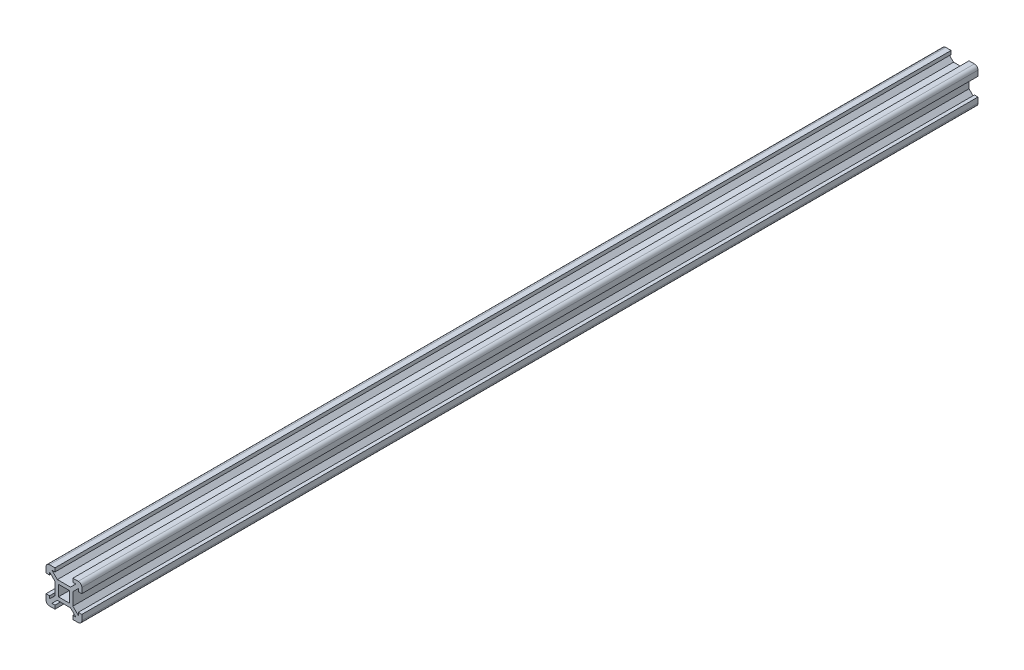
ISO-10303-21;
HEADER;
FILE_DESCRIPTION(('STEP AP214'),'2;1');
FILE_NAME('part.step','',(''),(''),'','','');
FILE_SCHEMA(('AUTOMOTIVE_DESIGN { 1 0 10303 214 1 1 1 1 }'));
ENDSEC;
DATA;
#1=APPLICATION_CONTEXT('core data for automotive mechanical design processes');
#2=APPLICATION_PROTOCOL_DEFINITION('international standard','automotive_design',2000,#1);
#3=PRODUCT_CONTEXT('',#1,'mechanical');
#4=PRODUCT('Part','Part','',(#3));
#5=PRODUCT_RELATED_PRODUCT_CATEGORY('part','',(#4));
#6=PRODUCT_DEFINITION_FORMATION('','',#4);
#7=PRODUCT_DEFINITION_CONTEXT('part definition',#1,'design');
#8=PRODUCT_DEFINITION('design','',#6,#7);
#9=PRODUCT_DEFINITION_SHAPE('','',#8);
#10=(LENGTH_UNIT() NAMED_UNIT(*) SI_UNIT(.MILLI.,.METRE.));
#11=(NAMED_UNIT(*) PLANE_ANGLE_UNIT() SI_UNIT($,.RADIAN.));
#12=(NAMED_UNIT(*) SI_UNIT($,.STERADIAN.) SOLID_ANGLE_UNIT());
#13=UNCERTAINTY_MEASURE_WITH_UNIT(LENGTH_MEASURE(1.E-05),#10,'distance_accuracy_value','');
#14=(GEOMETRIC_REPRESENTATION_CONTEXT(3) GLOBAL_UNCERTAINTY_ASSIGNED_CONTEXT((#13)) GLOBAL_UNIT_ASSIGNED_CONTEXT((#10,
#11,#12)) REPRESENTATION_CONTEXT('',''));
#15=CARTESIAN_POINT('',(0.,0.,0.));
#16=DIRECTION('',(0.,0.,1.));
#17=DIRECTION('',(1.,0.,0.));
#18=AXIS2_PLACEMENT_3D('',#15,#16,#17);
#19=CARTESIAN_POINT('',(2.00000000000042,18.0000000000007,500.));
#20=DIRECTION('',(0.,0.,-1.));
#21=DIRECTION('',(-1.,0.,0.));
#22=AXIS2_PLACEMENT_3D('',#19,#20,#21);
#23=PLANE('',#22);
#24=DIRECTION('',(0.712320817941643,-0.701854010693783,0.));
#25=VECTOR('',#24,1.);
#26=CARTESIAN_POINT('',(5.00000000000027,13.5226684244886,500.));
#27=LINE('',#26,#25);
#28=CARTESIAN_POINT('',(2.00000000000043,16.4785865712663,500.));
#29=VERTEX_POINT('',#28);
#30=CARTESIAN_POINT('',(5.00000000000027,13.5226684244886,500.));
#31=VERTEX_POINT('',#30);
#32=EDGE_CURVE('E348',#29,#31,#27,.T.);
#33=ORIENTED_EDGE('',*,*,#32,.T.);
#34=DIRECTION('',(0.,-1.,0.));
#35=VECTOR('',#34,1.);
#36=CARTESIAN_POINT('',(5.00000000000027,13.5226684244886,500.));
#37=LINE('',#36,#35);
#38=CARTESIAN_POINT('',(5.00000000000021,6.47733157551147,500.));
#39=VERTEX_POINT('',#38);
#40=EDGE_CURVE('E351',#31,#39,#37,.T.);
#41=ORIENTED_EDGE('',*,*,#40,.T.);
#42=DIRECTION('',(-0.712320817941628,-0.701854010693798,0.));
#43=VECTOR('',#42,1.);
#44=CARTESIAN_POINT('',(5.00000000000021,6.47733157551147,500.));
#45=LINE('',#44,#43);
#46=CARTESIAN_POINT('',(2.00000000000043,3.52141342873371,500.));
#47=VERTEX_POINT('',#46);
#48=EDGE_CURVE('E354',#39,#47,#45,.T.);
#49=ORIENTED_EDGE('',*,*,#48,.T.);
#50=DIRECTION('',(0.,1.,0.));
#51=VECTOR('',#50,1.);
#52=CARTESIAN_POINT('',(2.00000000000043,3.52141342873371,500.));
#53=LINE('',#52,#51);
#54=CARTESIAN_POINT('',(2.00000000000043,4.99999999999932,500.));
#55=VERTEX_POINT('',#54);
#56=EDGE_CURVE('E356',#47,#55,#53,.T.);
#57=ORIENTED_EDGE('',*,*,#56,.T.);
#58=DIRECTION('',(-1.,0.,0.));
#59=VECTOR('',#58,1.);
#60=CARTESIAN_POINT('',(4.24509251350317E-13,4.99999999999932,500.));
#61=LINE('',#60,#59);
#62=CARTESIAN_POINT('',(4.24509251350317E-13,4.99999999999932,500.));
#63=VERTEX_POINT('',#62);
#64=EDGE_CURVE('E358',#55,#63,#61,.T.);
#65=ORIENTED_EDGE('',*,*,#64,.T.);
#66=DIRECTION('',(0.,-1.,0.));
#67=VECTOR('',#66,1.);
#68=CARTESIAN_POINT('',(4.24509251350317E-13,4.99999999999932,500.));
#69=LINE('',#68,#67);
#70=CARTESIAN_POINT('',(4.24509251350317E-13,1.99999999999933,500.));
#71=VERTEX_POINT('',#70);
#72=EDGE_CURVE('E360',#63,#71,#69,.T.);
#73=ORIENTED_EDGE('',*,*,#72,.T.);
#74=CARTESIAN_POINT('',(2.00000000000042,1.99999999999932,500.));
#75=DIRECTION('',(0.,0.,1.));
#76=DIRECTION('',(1.,0.,0.));
#77=AXIS2_PLACEMENT_3D('',#74,#75,#76);
#78=CIRCLE('',#77,2.);
#79=CARTESIAN_POINT('',(2.00000000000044,-6.83481049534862E-13,500.));
#80=VERTEX_POINT('',#79);
#81=EDGE_CURVE('E362',#71,#80,#78,.T.);
#82=ORIENTED_EDGE('',*,*,#81,.T.);
#83=DIRECTION('',(1.,0.,0.));
#84=VECTOR('',#83,1.);
#85=CARTESIAN_POINT('',(2.00000000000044,-6.83481049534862E-13,500.));
#86=LINE('',#85,#84);
#87=CARTESIAN_POINT('',(5.,-6.83481049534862E-13,500.));
#88=VERTEX_POINT('',#87);
#89=EDGE_CURVE('E364',#80,#88,#86,.T.);
#90=ORIENTED_EDGE('',*,*,#89,.T.);
#91=DIRECTION('',(0.,1.,0.));
#92=VECTOR('',#91,1.);
#93=CARTESIAN_POINT('',(5.,-6.83481049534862E-13,500.));
#94=LINE('',#93,#92);
#95=CARTESIAN_POINT('',(5.,2.,500.));
#96=VERTEX_POINT('',#95);
#97=EDGE_CURVE('E366',#88,#96,#94,.T.);
#98=ORIENTED_EDGE('',*,*,#97,.T.);
#99=DIRECTION('',(-1.,0.,0.));
#100=VECTOR('',#99,1.);
#101=CARTESIAN_POINT('',(3.30549306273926,1.99999999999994,500.));
#102=LINE('',#101,#100);
#103=CARTESIAN_POINT('',(3.30549306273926,1.99999999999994,500.));
#104=VERTEX_POINT('',#103);
#105=EDGE_CURVE('E368',#96,#104,#102,.T.);
#106=ORIENTED_EDGE('',*,*,#105,.T.);
#107=DIRECTION('',(0.712320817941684,0.701854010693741,0.));
#108=VECTOR('',#107,1.);
#109=CARTESIAN_POINT('',(6.35023231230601,4.99999999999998,500.));
#110=LINE('',#109,#108);
#111=CARTESIAN_POINT('',(6.35023231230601,4.99999999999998,500.));
#112=VERTEX_POINT('',#111);
#113=EDGE_CURVE('E370',#104,#112,#110,.T.);
#114=ORIENTED_EDGE('',*,*,#113,.T.);
#115=DIRECTION('',(1.,0.,0.));
#116=VECTOR('',#115,1.);
#117=CARTESIAN_POINT('',(6.35023231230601,4.99999999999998,500.));
#118=LINE('',#117,#116);
#119=CARTESIAN_POINT('',(13.649767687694,4.99999999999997,500.));
#120=VERTEX_POINT('',#119);
#121=EDGE_CURVE('E372',#112,#120,#118,.T.);
#122=ORIENTED_EDGE('',*,*,#121,.T.);
#123=DIRECTION('',(0.712320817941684,-0.701854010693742,0.));
#124=VECTOR('',#123,1.);
#125=CARTESIAN_POINT('',(13.649767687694,4.99999999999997,500.));
#126=LINE('',#125,#124);
#127=CARTESIAN_POINT('',(16.6945069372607,1.99999999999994,500.));
#128=VERTEX_POINT('',#127);
#129=EDGE_CURVE('E374',#120,#128,#126,.T.);
#130=ORIENTED_EDGE('',*,*,#129,.T.);
#131=DIRECTION('',(-1.,0.,0.));
#132=VECTOR('',#131,1.);
#133=CARTESIAN_POINT('',(16.6945069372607,1.99999999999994,500.));
#134=LINE('',#133,#132);
#135=CARTESIAN_POINT('',(15.,2.,500.));
#136=VERTEX_POINT('',#135);
#137=EDGE_CURVE('E376',#128,#136,#134,.T.);
#138=ORIENTED_EDGE('',*,*,#137,.T.);
#139=DIRECTION('',(0.,-1.,0.));
#140=VECTOR('',#139,1.);
#141=CARTESIAN_POINT('',(15.,-6.83481049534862E-13,500.));
#142=LINE('',#141,#140);
#143=CARTESIAN_POINT('',(15.,-6.83481049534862E-13,500.));
#144=VERTEX_POINT('',#143);
#145=EDGE_CURVE('E378',#136,#144,#142,.T.);
#146=ORIENTED_EDGE('',*,*,#145,.T.);
#147=DIRECTION('',(1.,0.,0.));
#148=VECTOR('',#147,1.);
#149=CARTESIAN_POINT('',(17.9999999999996,-6.85562717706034E-13,500.));
#150=LINE('',#149,#148);
#151=CARTESIAN_POINT('',(17.9999999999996,-6.85562717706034E-13,500.));
#152=VERTEX_POINT('',#151);
#153=EDGE_CURVE('E380',#144,#152,#150,.T.);
#154=ORIENTED_EDGE('',*,*,#153,.T.);
#155=CARTESIAN_POINT('',(17.9999999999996,1.99999999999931,500.));
#156=DIRECTION('',(0.,0.,1.));
#157=DIRECTION('',(1.,0.,0.));
#158=AXIS2_PLACEMENT_3D('',#155,#156,#157);
#159=CIRCLE('',#158,2.);
#160=CARTESIAN_POINT('',(19.9999999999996,1.99999999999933,500.));
#161=VERTEX_POINT('',#160);
#162=EDGE_CURVE('E382',#152,#161,#159,.T.);
#163=ORIENTED_EDGE('',*,*,#162,.T.);
#164=DIRECTION('',(0.,1.,0.));
#165=VECTOR('',#164,1.);
#166=CARTESIAN_POINT('',(19.9999999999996,4.99999999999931,500.));
#167=LINE('',#166,#165);
#168=CARTESIAN_POINT('',(19.9999999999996,4.99999999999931,500.));
#169=VERTEX_POINT('',#168);
#170=EDGE_CURVE('E384',#161,#169,#167,.T.);
#171=ORIENTED_EDGE('',*,*,#170,.T.);
#172=DIRECTION('',(-1.,0.,0.));
#173=VECTOR('',#172,1.);
#174=CARTESIAN_POINT('',(19.9999999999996,4.99999999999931,500.));
#175=LINE('',#174,#173);
#176=CARTESIAN_POINT('',(17.9999999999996,4.99999999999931,500.));
#177=VERTEX_POINT('',#176);
#178=EDGE_CURVE('E386',#169,#177,#175,.T.);
#179=ORIENTED_EDGE('',*,*,#178,.T.);
#180=DIRECTION('',(0.,-1.,0.));
#181=VECTOR('',#180,1.);
#182=CARTESIAN_POINT('',(17.9999999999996,3.52141342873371,500.));
#183=LINE('',#182,#181);
#184=CARTESIAN_POINT('',(17.9999999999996,3.52141342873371,500.));
#185=VERTEX_POINT('',#184);
#186=EDGE_CURVE('E388',#177,#185,#183,.T.);
#187=ORIENTED_EDGE('',*,*,#186,.T.);
#188=DIRECTION('',(-0.712320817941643,0.701854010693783,0.));
#189=VECTOR('',#188,1.);
#190=CARTESIAN_POINT('',(14.9999999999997,6.47733157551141,500.));
#191=LINE('',#190,#189);
#192=CARTESIAN_POINT('',(14.9999999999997,6.47733157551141,500.));
#193=VERTEX_POINT('',#192);
#194=EDGE_CURVE('E390',#185,#193,#191,.T.);
#195=ORIENTED_EDGE('',*,*,#194,.T.);
#196=DIRECTION('',(0.,1.,0.));
#197=VECTOR('',#196,1.);
#198=CARTESIAN_POINT('',(14.9999999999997,13.5226684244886,500.));
#199=LINE('',#198,#197);
#200=CARTESIAN_POINT('',(14.9999999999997,13.5226684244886,500.));
#201=VERTEX_POINT('',#200);
#202=EDGE_CURVE('E392',#193,#201,#199,.T.);
#203=ORIENTED_EDGE('',*,*,#202,.T.);
#204=DIRECTION('',(0.712320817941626,0.7018540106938,0.));
#205=VECTOR('',#204,1.);
#206=CARTESIAN_POINT('',(14.9999999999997,13.5226684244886,500.));
#207=LINE('',#206,#205);
#208=CARTESIAN_POINT('',(17.9999999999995,16.4785865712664,500.));
#209=VERTEX_POINT('',#208);
#210=EDGE_CURVE('E394',#201,#209,#207,.T.);
#211=ORIENTED_EDGE('',*,*,#210,.T.);
#212=DIRECTION('',(0.,-1.,0.));
#213=VECTOR('',#212,1.);
#214=CARTESIAN_POINT('',(17.9999999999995,16.4785865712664,500.));
#215=LINE('',#214,#213);
#216=CARTESIAN_POINT('',(17.9999999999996,15.0000000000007,500.));
#217=VERTEX_POINT('',#216);
#218=EDGE_CURVE('E396',#209,#217,#215,.T.);
#219=ORIENTED_EDGE('',*,*,#218,.T.);
#220=DIRECTION('',(1.,0.,0.));
#221=VECTOR('',#220,1.);
#222=CARTESIAN_POINT('',(19.9999999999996,15.0000000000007,500.));
#223=LINE('',#222,#221);
#224=CARTESIAN_POINT('',(19.9999999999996,15.0000000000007,500.));
#225=VERTEX_POINT('',#224);
#226=EDGE_CURVE('E398',#217,#225,#223,.T.);
#227=ORIENTED_EDGE('',*,*,#226,.T.);
#228=DIRECTION('',(0.,1.,0.));
#229=VECTOR('',#228,1.);
#230=CARTESIAN_POINT('',(19.9999999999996,15.0000000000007,500.));
#231=LINE('',#230,#229);
#232=CARTESIAN_POINT('',(19.9999999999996,18.0000000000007,500.));
#233=VERTEX_POINT('',#232);
#234=EDGE_CURVE('E400',#225,#233,#231,.T.);
#235=ORIENTED_EDGE('',*,*,#234,.T.);
#236=CARTESIAN_POINT('',(17.9999999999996,18.0000000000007,500.));
#237=DIRECTION('',(0.,0.,1.));
#238=DIRECTION('',(1.,0.,0.));
#239=AXIS2_PLACEMENT_3D('',#236,#237,#238);
#240=CIRCLE('',#239,2.);
#241=CARTESIAN_POINT('',(17.9999999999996,20.0000000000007,500.));
#242=VERTEX_POINT('',#241);
#243=EDGE_CURVE('E402',#233,#242,#240,.T.);
#244=ORIENTED_EDGE('',*,*,#243,.T.);
#245=DIRECTION('',(-1.,0.,0.));
#246=VECTOR('',#245,1.);
#247=CARTESIAN_POINT('',(17.9999999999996,20.0000000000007,500.));
#248=LINE('',#247,#246);
#249=CARTESIAN_POINT('',(15.,20.0000000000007,500.));
#250=VERTEX_POINT('',#249);
#251=EDGE_CURVE('E404',#242,#250,#248,.T.);
#252=ORIENTED_EDGE('',*,*,#251,.T.);
#253=DIRECTION('',(0.,-1.,0.));
#254=VECTOR('',#253,1.);
#255=CARTESIAN_POINT('',(15.,20.0000000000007,500.));
#256=LINE('',#255,#254);
#257=CARTESIAN_POINT('',(15.,18.,500.));
#258=VERTEX_POINT('',#257);
#259=EDGE_CURVE('E406',#250,#258,#256,.T.);
#260=ORIENTED_EDGE('',*,*,#259,.T.);
#261=DIRECTION('',(1.,0.,0.));
#262=VECTOR('',#261,1.);
#263=CARTESIAN_POINT('',(16.6945069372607,18.0000000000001,500.));
#264=LINE('',#263,#262);
#265=CARTESIAN_POINT('',(16.6945069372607,18.0000000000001,500.));
#266=VERTEX_POINT('',#265);
#267=EDGE_CURVE('E408',#258,#266,#264,.T.);
#268=ORIENTED_EDGE('',*,*,#267,.T.);
#269=DIRECTION('',(-0.712320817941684,-0.701854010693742,0.));
#270=VECTOR('',#269,1.);
#271=CARTESIAN_POINT('',(13.649767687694,15.,500.));
#272=LINE('',#271,#270);
#273=CARTESIAN_POINT('',(13.649767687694,15.,500.));
#274=VERTEX_POINT('',#273);
#275=EDGE_CURVE('E410',#266,#274,#272,.T.);
#276=ORIENTED_EDGE('',*,*,#275,.T.);
#277=DIRECTION('',(-1.,0.,0.));
#278=VECTOR('',#277,1.);
#279=CARTESIAN_POINT('',(6.35023231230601,15.,500.));
#280=LINE('',#279,#278);
#281=CARTESIAN_POINT('',(6.35023231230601,15.,500.));
#282=VERTEX_POINT('',#281);
#283=EDGE_CURVE('E412',#274,#282,#280,.T.);
#284=ORIENTED_EDGE('',*,*,#283,.T.);
#285=DIRECTION('',(-0.712320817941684,0.701854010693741,0.));
#286=VECTOR('',#285,1.);
#287=CARTESIAN_POINT('',(6.35023231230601,15.,500.));
#288=LINE('',#287,#286);
#289=CARTESIAN_POINT('',(3.30549306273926,18.0000000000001,500.));
#290=VERTEX_POINT('',#289);
#291=EDGE_CURVE('E414',#282,#290,#288,.T.);
#292=ORIENTED_EDGE('',*,*,#291,.T.);
#293=DIRECTION('',(1.,0.,0.));
#294=VECTOR('',#293,1.);
#295=CARTESIAN_POINT('',(3.30549306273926,18.0000000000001,500.));
#296=LINE('',#295,#294);
#297=CARTESIAN_POINT('',(5.,18.,500.));
#298=VERTEX_POINT('',#297);
#299=EDGE_CURVE('E416',#290,#298,#296,.T.);
#300=ORIENTED_EDGE('',*,*,#299,.T.);
#301=DIRECTION('',(0.,1.,0.));
#302=VECTOR('',#301,1.);
#303=CARTESIAN_POINT('',(5.,20.0000000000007,500.));
#304=LINE('',#303,#302);
#305=CARTESIAN_POINT('',(5.,20.0000000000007,500.));
#306=VERTEX_POINT('',#305);
#307=EDGE_CURVE('E418',#298,#306,#304,.T.);
#308=ORIENTED_EDGE('',*,*,#307,.T.);
#309=DIRECTION('',(-1.,0.,0.));
#310=VECTOR('',#309,1.);
#311=CARTESIAN_POINT('',(2.00000000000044,20.0000000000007,500.));
#312=LINE('',#311,#310);
#313=CARTESIAN_POINT('',(2.00000000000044,20.0000000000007,500.));
#314=VERTEX_POINT('',#313);
#315=EDGE_CURVE('E420',#306,#314,#312,.T.);
#316=ORIENTED_EDGE('',*,*,#315,.T.);
#317=CARTESIAN_POINT('',(2.00000000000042,18.0000000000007,500.));
#318=DIRECTION('',(0.,0.,1.));
#319=DIRECTION('',(-1.,0.,0.));
#320=AXIS2_PLACEMENT_3D('',#317,#318,#319);
#321=CIRCLE('',#320,2.);
#322=CARTESIAN_POINT('',(4.25007251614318E-13,18.0000000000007,500.));
#323=VERTEX_POINT('',#322);
#324=EDGE_CURVE('E422',#314,#323,#321,.T.);
#325=ORIENTED_EDGE('',*,*,#324,.T.);
#326=DIRECTION('',(0.,-1.,0.));
#327=VECTOR('',#326,1.);
#328=CARTESIAN_POINT('',(4.24509251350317E-13,15.0000000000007,500.));
#329=LINE('',#328,#327);
#330=CARTESIAN_POINT('',(4.24509251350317E-13,15.0000000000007,500.));
#331=VERTEX_POINT('',#330);
#332=EDGE_CURVE('E424',#323,#331,#329,.T.);
#333=ORIENTED_EDGE('',*,*,#332,.T.);
#334=DIRECTION('',(1.,0.,0.));
#335=VECTOR('',#334,1.);
#336=CARTESIAN_POINT('',(4.24509251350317E-13,15.0000000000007,500.));
#337=LINE('',#336,#335);
#338=CARTESIAN_POINT('',(2.00000000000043,15.0000000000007,500.));
#339=VERTEX_POINT('',#338);
#340=EDGE_CURVE('E426',#331,#339,#337,.T.);
#341=ORIENTED_EDGE('',*,*,#340,.T.);
#342=DIRECTION('',(0.,1.,0.));
#343=VECTOR('',#342,1.);
#344=CARTESIAN_POINT('',(2.00000000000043,16.4785865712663,500.));
#345=LINE('',#344,#343);
#346=EDGE_CURVE('E428',#339,#29,#345,.T.);
#347=ORIENTED_EDGE('',*,*,#346,.T.);
#348=EDGE_LOOP('',(#33,#41,#49,#57,#65,#73,#82,#90,#98,#106,#114,#122,#130,#138,#146,#154,#163,
#171,#179,#187,#195,#203,#211,#219,#227,#235,#244,#252,#260,#268,#276,#284,#292,#300,#308,#316,
#325,#333,#341,#347));
#349=FACE_BOUND('',#348,.T.);
#350=DIRECTION('',(0.,1.,0.));
#351=VECTOR('',#350,1.);
#352=CARTESIAN_POINT('',(13.0427076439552,13.0427076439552,500.));
#353=LINE('',#352,#351);
#354=CARTESIAN_POINT('',(13.0427076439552,6.9572923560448,500.));
#355=VERTEX_POINT('',#354);
#356=CARTESIAN_POINT('',(13.0427076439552,13.0427076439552,500.));
#357=VERTEX_POINT('',#356);
#358=EDGE_CURVE('E312',#355,#357,#353,.T.);
#359=ORIENTED_EDGE('',*,*,#358,.F.);
#360=DIRECTION('',(1.,0.,0.));
#361=VECTOR('',#360,1.);
#362=CARTESIAN_POINT('',(6.95729235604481,6.9572923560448,500.));
#363=LINE('',#362,#361);
#364=CARTESIAN_POINT('',(6.95729235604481,6.9572923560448,500.));
#365=VERTEX_POINT('',#364);
#366=EDGE_CURVE('E334',#365,#355,#363,.T.);
#367=ORIENTED_EDGE('',*,*,#366,.F.);
#368=DIRECTION('',(0.,-1.,0.));
#369=VECTOR('',#368,1.);
#370=CARTESIAN_POINT('',(6.95729235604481,13.0427076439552,500.));
#371=LINE('',#370,#369);
#372=CARTESIAN_POINT('',(6.95729235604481,13.0427076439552,500.));
#373=VERTEX_POINT('',#372);
#374=EDGE_CURVE('E332',#373,#365,#371,.T.);
#375=ORIENTED_EDGE('',*,*,#374,.F.);
#376=DIRECTION('',(-1.,0.,0.));
#377=VECTOR('',#376,1.);
#378=CARTESIAN_POINT('',(6.95729235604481,13.0427076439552,500.));
#379=LINE('',#378,#377);
#380=EDGE_CURVE('E320',#357,#373,#379,.T.);
#381=ORIENTED_EDGE('',*,*,#380,.F.);
#382=EDGE_LOOP('',(#359,#367,#375,#381));
#383=FACE_BOUND('',#382,.T.);
#384=ADVANCED_FACE('F31',(#349,#383),#23,.F.);
#385=CARTESIAN_POINT('',(2.00000000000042,18.0000000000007,0.));
#386=DIRECTION('',(0.,0.,-1.));
#387=DIRECTION('',(-1.,0.,0.));
#388=AXIS2_PLACEMENT_3D('',#385,#386,#387);
#389=PLANE('',#388);
#390=DIRECTION('',(0.712320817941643,-0.701854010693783,0.));
#391=VECTOR('',#390,1.);
#392=CARTESIAN_POINT('',(5.00000000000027,13.5226684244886,0.));
#393=LINE('',#392,#391);
#394=CARTESIAN_POINT('',(2.00000000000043,16.4785865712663,0.));
#395=VERTEX_POINT('',#394);
#396=CARTESIAN_POINT('',(5.00000000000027,13.5226684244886,0.));
#397=VERTEX_POINT('',#396);
#398=EDGE_CURVE('E328',#395,#397,#393,.T.);
#399=ORIENTED_EDGE('',*,*,#398,.F.);
#400=DIRECTION('',(0.,1.,0.));
#401=VECTOR('',#400,1.);
#402=CARTESIAN_POINT('',(2.00000000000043,16.4785865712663,0.));
#403=LINE('',#402,#401);
#404=CARTESIAN_POINT('',(2.00000000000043,15.0000000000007,0.));
#405=VERTEX_POINT('',#404);
#406=EDGE_CURVE('E352',#405,#395,#403,.T.);
#407=ORIENTED_EDGE('',*,*,#406,.F.);
#408=DIRECTION('',(1.,0.,0.));
#409=VECTOR('',#408,1.);
#410=CARTESIAN_POINT('',(4.24509251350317E-13,15.0000000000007,0.));
#411=LINE('',#410,#409);
#412=CARTESIAN_POINT('',(4.24509251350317E-13,15.0000000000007,0.));
#413=VERTEX_POINT('',#412);
#414=EDGE_CURVE('E507',#413,#405,#411,.T.);
#415=ORIENTED_EDGE('',*,*,#414,.F.);
#416=DIRECTION('',(0.,-1.,0.));
#417=VECTOR('',#416,1.);
#418=CARTESIAN_POINT('',(4.24509251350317E-13,15.0000000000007,0.));
#419=LINE('',#418,#417);
#420=CARTESIAN_POINT('',(4.25007251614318E-13,18.0000000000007,0.));
#421=VERTEX_POINT('',#420);
#422=EDGE_CURVE('E505',#421,#413,#419,.T.);
#423=ORIENTED_EDGE('',*,*,#422,.F.);
#424=CARTESIAN_POINT('',(2.00000000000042,18.0000000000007,0.));
#425=DIRECTION('',(0.,0.,1.));
#426=DIRECTION('',(-1.,0.,0.));
#427=AXIS2_PLACEMENT_3D('',#424,#425,#426);
#428=CIRCLE('',#427,2.);
#429=CARTESIAN_POINT('',(2.00000000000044,20.0000000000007,0.));
#430=VERTEX_POINT('',#429);
#431=EDGE_CURVE('E503',#430,#421,#428,.T.);
#432=ORIENTED_EDGE('',*,*,#431,.F.);
#433=DIRECTION('',(-1.,0.,0.));
#434=VECTOR('',#433,1.);
#435=CARTESIAN_POINT('',(2.00000000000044,20.0000000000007,0.));
#436=LINE('',#435,#434);
#437=CARTESIAN_POINT('',(5.,20.0000000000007,0.));
#438=VERTEX_POINT('',#437);
#439=EDGE_CURVE('E501',#438,#430,#436,.T.);
#440=ORIENTED_EDGE('',*,*,#439,.F.);
#441=DIRECTION('',(0.,1.,0.));
#442=VECTOR('',#441,1.);
#443=CARTESIAN_POINT('',(5.,20.0000000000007,0.));
#444=LINE('',#443,#442);
#445=CARTESIAN_POINT('',(5.,18.,0.));
#446=VERTEX_POINT('',#445);
#447=EDGE_CURVE('E499',#446,#438,#444,.T.);
#448=ORIENTED_EDGE('',*,*,#447,.F.);
#449=DIRECTION('',(1.,0.,0.));
#450=VECTOR('',#449,1.);
#451=CARTESIAN_POINT('',(3.30549306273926,18.0000000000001,0.));
#452=LINE('',#451,#450);
#453=CARTESIAN_POINT('',(3.30549306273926,18.0000000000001,0.));
#454=VERTEX_POINT('',#453);
#455=EDGE_CURVE('E497',#454,#446,#452,.T.);
#456=ORIENTED_EDGE('',*,*,#455,.F.);
#457=DIRECTION('',(-0.712320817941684,0.701854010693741,0.));
#458=VECTOR('',#457,1.);
#459=CARTESIAN_POINT('',(6.35023231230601,15.,0.));
#460=LINE('',#459,#458);
#461=CARTESIAN_POINT('',(6.35023231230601,15.,0.));
#462=VERTEX_POINT('',#461);
#463=EDGE_CURVE('E495',#462,#454,#460,.T.);
#464=ORIENTED_EDGE('',*,*,#463,.F.);
#465=DIRECTION('',(-1.,0.,0.));
#466=VECTOR('',#465,1.);
#467=CARTESIAN_POINT('',(6.35023231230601,15.,0.));
#468=LINE('',#467,#466);
#469=CARTESIAN_POINT('',(13.649767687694,15.,0.));
#470=VERTEX_POINT('',#469);
#471=EDGE_CURVE('E493',#470,#462,#468,.T.);
#472=ORIENTED_EDGE('',*,*,#471,.F.);
#473=DIRECTION('',(-0.712320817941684,-0.701854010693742,0.));
#474=VECTOR('',#473,1.);
#475=CARTESIAN_POINT('',(13.649767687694,15.,0.));
#476=LINE('',#475,#474);
#477=CARTESIAN_POINT('',(16.6945069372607,18.0000000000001,0.));
#478=VERTEX_POINT('',#477);
#479=EDGE_CURVE('E491',#478,#470,#476,.T.);
#480=ORIENTED_EDGE('',*,*,#479,.F.);
#481=DIRECTION('',(1.,0.,0.));
#482=VECTOR('',#481,1.);
#483=CARTESIAN_POINT('',(16.6945069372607,18.0000000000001,0.));
#484=LINE('',#483,#482);
#485=CARTESIAN_POINT('',(15.,18.,0.));
#486=VERTEX_POINT('',#485);
#487=EDGE_CURVE('E489',#486,#478,#484,.T.);
#488=ORIENTED_EDGE('',*,*,#487,.F.);
#489=DIRECTION('',(0.,-1.,0.));
#490=VECTOR('',#489,1.);
#491=CARTESIAN_POINT('',(15.,20.0000000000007,0.));
#492=LINE('',#491,#490);
#493=CARTESIAN_POINT('',(15.,20.0000000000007,0.));
#494=VERTEX_POINT('',#493);
#495=EDGE_CURVE('E487',#494,#486,#492,.T.);
#496=ORIENTED_EDGE('',*,*,#495,.F.);
#497=DIRECTION('',(-1.,0.,0.));
#498=VECTOR('',#497,1.);
#499=CARTESIAN_POINT('',(17.9999999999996,20.0000000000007,0.));
#500=LINE('',#499,#498);
#501=CARTESIAN_POINT('',(17.9999999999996,20.0000000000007,0.));
#502=VERTEX_POINT('',#501);
#503=EDGE_CURVE('E485',#502,#494,#500,.T.);
#504=ORIENTED_EDGE('',*,*,#503,.F.);
#505=CARTESIAN_POINT('',(17.9999999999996,18.0000000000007,0.));
#506=DIRECTION('',(0.,0.,1.));
#507=DIRECTION('',(1.,0.,0.));
#508=AXIS2_PLACEMENT_3D('',#505,#506,#507);
#509=CIRCLE('',#508,2.);
#510=CARTESIAN_POINT('',(19.9999999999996,18.0000000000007,0.));
#511=VERTEX_POINT('',#510);
#512=EDGE_CURVE('E483',#511,#502,#509,.T.);
#513=ORIENTED_EDGE('',*,*,#512,.F.);
#514=DIRECTION('',(0.,1.,0.));
#515=VECTOR('',#514,1.);
#516=CARTESIAN_POINT('',(19.9999999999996,15.0000000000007,0.));
#517=LINE('',#516,#515);
#518=CARTESIAN_POINT('',(19.9999999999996,15.0000000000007,0.));
#519=VERTEX_POINT('',#518);
#520=EDGE_CURVE('E481',#519,#511,#517,.T.);
#521=ORIENTED_EDGE('',*,*,#520,.F.);
#522=DIRECTION('',(1.,0.,0.));
#523=VECTOR('',#522,1.);
#524=CARTESIAN_POINT('',(19.9999999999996,15.0000000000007,0.));
#525=LINE('',#524,#523);
#526=CARTESIAN_POINT('',(17.9999999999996,15.0000000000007,0.));
#527=VERTEX_POINT('',#526);
#528=EDGE_CURVE('E479',#527,#519,#525,.T.);
#529=ORIENTED_EDGE('',*,*,#528,.F.);
#530=DIRECTION('',(0.,-1.,0.));
#531=VECTOR('',#530,1.);
#532=CARTESIAN_POINT('',(17.9999999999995,16.4785865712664,0.));
#533=LINE('',#532,#531);
#534=CARTESIAN_POINT('',(17.9999999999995,16.4785865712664,0.));
#535=VERTEX_POINT('',#534);
#536=EDGE_CURVE('E477',#535,#527,#533,.T.);
#537=ORIENTED_EDGE('',*,*,#536,.F.);
#538=DIRECTION('',(0.712320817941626,0.7018540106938,0.));
#539=VECTOR('',#538,1.);
#540=CARTESIAN_POINT('',(14.9999999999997,13.5226684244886,0.));
#541=LINE('',#540,#539);
#542=CARTESIAN_POINT('',(14.9999999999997,13.5226684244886,0.));
#543=VERTEX_POINT('',#542);
#544=EDGE_CURVE('E475',#543,#535,#541,.T.);
#545=ORIENTED_EDGE('',*,*,#544,.F.);
#546=DIRECTION('',(0.,1.,0.));
#547=VECTOR('',#546,1.);
#548=CARTESIAN_POINT('',(14.9999999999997,13.5226684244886,0.));
#549=LINE('',#548,#547);
#550=CARTESIAN_POINT('',(14.9999999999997,6.47733157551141,0.));
#551=VERTEX_POINT('',#550);
#552=EDGE_CURVE('E473',#551,#543,#549,.T.);
#553=ORIENTED_EDGE('',*,*,#552,.F.);
#554=DIRECTION('',(-0.712320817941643,0.701854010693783,0.));
#555=VECTOR('',#554,1.);
#556=CARTESIAN_POINT('',(14.9999999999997,6.47733157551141,0.));
#557=LINE('',#556,#555);
#558=CARTESIAN_POINT('',(17.9999999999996,3.52141342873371,0.));
#559=VERTEX_POINT('',#558);
#560=EDGE_CURVE('E471',#559,#551,#557,.T.);
#561=ORIENTED_EDGE('',*,*,#560,.F.);
#562=DIRECTION('',(0.,-1.,0.));
#563=VECTOR('',#562,1.);
#564=CARTESIAN_POINT('',(17.9999999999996,3.52141342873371,0.));
#565=LINE('',#564,#563);
#566=CARTESIAN_POINT('',(17.9999999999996,4.99999999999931,0.));
#567=VERTEX_POINT('',#566);
#568=EDGE_CURVE('E469',#567,#559,#565,.T.);
#569=ORIENTED_EDGE('',*,*,#568,.F.);
#570=DIRECTION('',(-1.,0.,0.));
#571=VECTOR('',#570,1.);
#572=CARTESIAN_POINT('',(19.9999999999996,4.99999999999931,0.));
#573=LINE('',#572,#571);
#574=CARTESIAN_POINT('',(19.9999999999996,4.99999999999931,0.));
#575=VERTEX_POINT('',#574);
#576=EDGE_CURVE('E467',#575,#567,#573,.T.);
#577=ORIENTED_EDGE('',*,*,#576,.F.);
#578=DIRECTION('',(0.,1.,0.));
#579=VECTOR('',#578,1.);
#580=CARTESIAN_POINT('',(19.9999999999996,4.99999999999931,0.));
#581=LINE('',#580,#579);
#582=CARTESIAN_POINT('',(19.9999999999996,1.99999999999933,0.));
#583=VERTEX_POINT('',#582);
#584=EDGE_CURVE('E465',#583,#575,#581,.T.);
#585=ORIENTED_EDGE('',*,*,#584,.F.);
#586=CARTESIAN_POINT('',(17.9999999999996,1.99999999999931,0.));
#587=DIRECTION('',(0.,0.,1.));
#588=DIRECTION('',(1.,0.,0.));
#589=AXIS2_PLACEMENT_3D('',#586,#587,#588);
#590=CIRCLE('',#589,2.);
#591=CARTESIAN_POINT('',(17.9999999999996,-6.85562717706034E-13,0.));
#592=VERTEX_POINT('',#591);
#593=EDGE_CURVE('E463',#592,#583,#590,.T.);
#594=ORIENTED_EDGE('',*,*,#593,.F.);
#595=DIRECTION('',(1.,0.,0.));
#596=VECTOR('',#595,1.);
#597=CARTESIAN_POINT('',(17.9999999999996,-6.85562717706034E-13,0.));
#598=LINE('',#597,#596);
#599=CARTESIAN_POINT('',(15.,-6.83481049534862E-13,0.));
#600=VERTEX_POINT('',#599);
#601=EDGE_CURVE('E461',#600,#592,#598,.T.);
#602=ORIENTED_EDGE('',*,*,#601,.F.);
#603=DIRECTION('',(0.,-1.,0.));
#604=VECTOR('',#603,1.);
#605=CARTESIAN_POINT('',(15.,-6.83481049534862E-13,0.));
#606=LINE('',#605,#604);
#607=CARTESIAN_POINT('',(15.,2.,0.));
#608=VERTEX_POINT('',#607);
#609=EDGE_CURVE('E459',#608,#600,#606,.T.);
#610=ORIENTED_EDGE('',*,*,#609,.F.);
#611=DIRECTION('',(-1.,0.,0.));
#612=VECTOR('',#611,1.);
#613=CARTESIAN_POINT('',(16.6945069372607,1.99999999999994,0.));
#614=LINE('',#613,#612);
#615=CARTESIAN_POINT('',(16.6945069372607,1.99999999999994,0.));
#616=VERTEX_POINT('',#615);
#617=EDGE_CURVE('E457',#616,#608,#614,.T.);
#618=ORIENTED_EDGE('',*,*,#617,.F.);
#619=DIRECTION('',(0.712320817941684,-0.701854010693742,0.));
#620=VECTOR('',#619,1.);
#621=CARTESIAN_POINT('',(13.649767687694,4.99999999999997,0.));
#622=LINE('',#621,#620);
#623=CARTESIAN_POINT('',(13.649767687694,4.99999999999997,0.));
#624=VERTEX_POINT('',#623);
#625=EDGE_CURVE('E455',#624,#616,#622,.T.);
#626=ORIENTED_EDGE('',*,*,#625,.F.);
#627=DIRECTION('',(1.,0.,0.));
#628=VECTOR('',#627,1.);
#629=CARTESIAN_POINT('',(6.35023231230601,4.99999999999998,0.));
#630=LINE('',#629,#628);
#631=CARTESIAN_POINT('',(6.35023231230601,4.99999999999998,0.));
#632=VERTEX_POINT('',#631);
#633=EDGE_CURVE('E453',#632,#624,#630,.T.);
#634=ORIENTED_EDGE('',*,*,#633,.F.);
#635=DIRECTION('',(0.712320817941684,0.701854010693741,0.));
#636=VECTOR('',#635,1.);
#637=CARTESIAN_POINT('',(6.35023231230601,4.99999999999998,0.));
#638=LINE('',#637,#636);
#639=CARTESIAN_POINT('',(3.30549306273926,1.99999999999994,0.));
#640=VERTEX_POINT('',#639);
#641=EDGE_CURVE('E451',#640,#632,#638,.T.);
#642=ORIENTED_EDGE('',*,*,#641,.F.);
#643=DIRECTION('',(-1.,0.,0.));
#644=VECTOR('',#643,1.);
#645=CARTESIAN_POINT('',(3.30549306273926,1.99999999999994,0.));
#646=LINE('',#645,#644);
#647=CARTESIAN_POINT('',(5.,2.,0.));
#648=VERTEX_POINT('',#647);
#649=EDGE_CURVE('E449',#648,#640,#646,.T.);
#650=ORIENTED_EDGE('',*,*,#649,.F.);
#651=DIRECTION('',(0.,1.,0.));
#652=VECTOR('',#651,1.);
#653=CARTESIAN_POINT('',(5.,-6.83481049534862E-13,0.));
#654=LINE('',#653,#652);
#655=CARTESIAN_POINT('',(5.,-6.83481049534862E-13,0.));
#656=VERTEX_POINT('',#655);
#657=EDGE_CURVE('E447',#656,#648,#654,.T.);
#658=ORIENTED_EDGE('',*,*,#657,.F.);
#659=DIRECTION('',(1.,0.,0.));
#660=VECTOR('',#659,1.);
#661=CARTESIAN_POINT('',(2.00000000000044,-6.83481049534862E-13,0.));
#662=LINE('',#661,#660);
#663=CARTESIAN_POINT('',(2.00000000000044,-6.83481049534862E-13,0.));
#664=VERTEX_POINT('',#663);
#665=EDGE_CURVE('E445',#664,#656,#662,.T.);
#666=ORIENTED_EDGE('',*,*,#665,.F.);
#667=CARTESIAN_POINT('',(2.00000000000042,1.99999999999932,0.));
#668=DIRECTION('',(0.,0.,1.));
#669=DIRECTION('',(1.,0.,0.));
#670=AXIS2_PLACEMENT_3D('',#667,#668,#669);
#671=CIRCLE('',#670,2.);
#672=CARTESIAN_POINT('',(4.24509251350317E-13,1.99999999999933,0.));
#673=VERTEX_POINT('',#672);
#674=EDGE_CURVE('E443',#673,#664,#671,.T.);
#675=ORIENTED_EDGE('',*,*,#674,.F.);
#676=DIRECTION('',(0.,-1.,0.));
#677=VECTOR('',#676,1.);
#678=CARTESIAN_POINT('',(4.24509251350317E-13,4.99999999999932,0.));
#679=LINE('',#678,#677);
#680=CARTESIAN_POINT('',(4.24509251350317E-13,4.99999999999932,0.));
#681=VERTEX_POINT('',#680);
#682=EDGE_CURVE('E441',#681,#673,#679,.T.);
#683=ORIENTED_EDGE('',*,*,#682,.F.);
#684=DIRECTION('',(-1.,0.,0.));
#685=VECTOR('',#684,1.);
#686=CARTESIAN_POINT('',(4.24509251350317E-13,4.99999999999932,0.));
#687=LINE('',#686,#685);
#688=CARTESIAN_POINT('',(2.00000000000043,4.99999999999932,0.));
#689=VERTEX_POINT('',#688);
#690=EDGE_CURVE('E439',#689,#681,#687,.T.);
#691=ORIENTED_EDGE('',*,*,#690,.F.);
#692=DIRECTION('',(0.,1.,0.));
#693=VECTOR('',#692,1.);
#694=CARTESIAN_POINT('',(2.00000000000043,3.52141342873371,0.));
#695=LINE('',#694,#693);
#696=CARTESIAN_POINT('',(2.00000000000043,3.52141342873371,0.));
#697=VERTEX_POINT('',#696);
#698=EDGE_CURVE('E437',#697,#689,#695,.T.);
#699=ORIENTED_EDGE('',*,*,#698,.F.);
#700=DIRECTION('',(-0.712320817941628,-0.701854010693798,0.));
#701=VECTOR('',#700,1.);
#702=CARTESIAN_POINT('',(5.00000000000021,6.47733157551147,0.));
#703=LINE('',#702,#701);
#704=CARTESIAN_POINT('',(5.00000000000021,6.47733157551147,0.));
#705=VERTEX_POINT('',#704);
#706=EDGE_CURVE('E435',#705,#697,#703,.T.);
#707=ORIENTED_EDGE('',*,*,#706,.F.);
#708=DIRECTION('',(0.,-1.,0.));
#709=VECTOR('',#708,1.);
#710=CARTESIAN_POINT('',(5.00000000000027,13.5226684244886,0.));
#711=LINE('',#710,#709);
#712=EDGE_CURVE('E433',#397,#705,#711,.T.);
#713=ORIENTED_EDGE('',*,*,#712,.F.);
#714=EDGE_LOOP('',(#399,#407,#415,#423,#432,#440,#448,#456,#464,#472,#480,#488,#496,#504,#513,
#521,#529,#537,#545,#553,#561,#569,#577,#585,#594,#602,#610,#618,#626,#634,#642,#650,#658,#666,
#675,#683,#691,#699,#707,#713));
#715=FACE_BOUND('',#714,.T.);
#716=DIRECTION('',(1.,0.,0.));
#717=VECTOR('',#716,1.);
#718=CARTESIAN_POINT('',(6.95729235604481,6.9572923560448,0.));
#719=LINE('',#718,#717);
#720=CARTESIAN_POINT('',(6.95729235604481,6.9572923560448,0.));
#721=VERTEX_POINT('',#720);
#722=CARTESIAN_POINT('',(13.0427076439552,6.9572923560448,0.));
#723=VERTEX_POINT('',#722);
#724=EDGE_CURVE('E321',#721,#723,#719,.T.);
#725=ORIENTED_EDGE('',*,*,#724,.T.);
#726=DIRECTION('',(0.,1.,0.));
#727=VECTOR('',#726,1.);
#728=CARTESIAN_POINT('',(13.0427076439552,13.0427076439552,0.));
#729=LINE('',#728,#727);
#730=CARTESIAN_POINT('',(13.0427076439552,13.0427076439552,0.));
#731=VERTEX_POINT('',#730);
#732=EDGE_CURVE('E54',#723,#731,#729,.T.);
#733=ORIENTED_EDGE('',*,*,#732,.T.);
#734=DIRECTION('',(-1.,0.,0.));
#735=VECTOR('',#734,1.);
#736=CARTESIAN_POINT('',(6.95729235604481,13.0427076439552,0.));
#737=LINE('',#736,#735);
#738=CARTESIAN_POINT('',(6.95729235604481,13.0427076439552,0.));
#739=VERTEX_POINT('',#738);
#740=EDGE_CURVE('E327',#731,#739,#737,.T.);
#741=ORIENTED_EDGE('',*,*,#740,.T.);
#742=DIRECTION('',(0.,-1.,0.));
#743=VECTOR('',#742,1.);
#744=CARTESIAN_POINT('',(6.95729235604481,13.0427076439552,0.));
#745=LINE('',#744,#743);
#746=EDGE_CURVE('E340',#739,#721,#745,.T.);
#747=ORIENTED_EDGE('',*,*,#746,.T.);
#748=EDGE_LOOP('',(#725,#733,#741,#747));
#749=FACE_BOUND('',#748,.T.);
#750=ADVANCED_FACE('F633',(#715,#749),#389,.T.);
#751=CARTESIAN_POINT('',(5.00000000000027,13.5226684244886,500.));
#752=DIRECTION('',(0.701854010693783,0.712320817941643,0.));
#753=DIRECTION('',(-0.712320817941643,0.701854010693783,0.));
#754=AXIS2_PLACEMENT_3D('',#751,#752,#753);
#755=PLANE('',#754);
#756=ORIENTED_EDGE('',*,*,#398,.T.);
#757=DIRECTION('',(0.,0.,-1.));
#758=VECTOR('',#757,1.);
#759=CARTESIAN_POINT('',(5.00000000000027,13.5226684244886,500.));
#760=LINE('',#759,#758);
#761=EDGE_CURVE('E11',#31,#397,#760,.T.);
#762=ORIENTED_EDGE('',*,*,#761,.F.);
#763=ORIENTED_EDGE('',*,*,#32,.F.);
#764=DIRECTION('',(0.,0.,-1.));
#765=VECTOR('',#764,1.);
#766=CARTESIAN_POINT('',(2.00000000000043,16.4785865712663,500.));
#767=LINE('',#766,#765);
#768=EDGE_CURVE('E430',#29,#395,#767,.T.);
#769=ORIENTED_EDGE('',*,*,#768,.T.);
#770=EDGE_LOOP('',(#756,#762,#763,#769));
#771=FACE_BOUND('',#770,.T.);
#772=ADVANCED_FACE('F33',(#771),#755,.F.);
#773=CARTESIAN_POINT('',(5.00000000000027,13.5226684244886,500.));
#774=DIRECTION('',(1.,0.,0.));
#775=DIRECTION('',(0.,1.,0.));
#776=AXIS2_PLACEMENT_3D('',#773,#774,#775);
#777=PLANE('',#776);
#778=ORIENTED_EDGE('',*,*,#712,.T.);
#779=DIRECTION('',(0.,0.,-1.));
#780=VECTOR('',#779,1.);
#781=CARTESIAN_POINT('',(5.00000000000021,6.47733157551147,500.));
#782=LINE('',#781,#780);
#783=EDGE_CURVE('E39',#39,#705,#782,.T.);
#784=ORIENTED_EDGE('',*,*,#783,.F.);
#785=ORIENTED_EDGE('',*,*,#40,.F.);
#786=ORIENTED_EDGE('',*,*,#761,.T.);
#787=EDGE_LOOP('',(#778,#784,#785,#786));
#788=FACE_BOUND('',#787,.T.);
#789=ADVANCED_FACE('F650',(#788),#777,.F.);
#790=CARTESIAN_POINT('',(5.00000000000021,6.47733157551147,500.));
#791=DIRECTION('',(0.701854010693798,-0.712320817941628,0.));
#792=DIRECTION('',(0.712320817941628,0.701854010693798,0.));
#793=AXIS2_PLACEMENT_3D('',#790,#791,#792);
#794=PLANE('',#793);
#795=ORIENTED_EDGE('',*,*,#706,.T.);
#796=DIRECTION('',(0.,0.,-1.));
#797=VECTOR('',#796,1.);
#798=CARTESIAN_POINT('',(2.00000000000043,3.52141342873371,500.));
#799=LINE('',#798,#797);
#800=EDGE_CURVE('E620',#47,#697,#799,.T.);
#801=ORIENTED_EDGE('',*,*,#800,.F.);
#802=ORIENTED_EDGE('',*,*,#48,.F.);
#803=ORIENTED_EDGE('',*,*,#783,.T.);
#804=EDGE_LOOP('',(#795,#801,#802,#803));
#805=FACE_BOUND('',#804,.T.);
#806=ADVANCED_FACE('F627',(#805),#794,.F.);
#807=CARTESIAN_POINT('',(2.00000000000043,3.52141342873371,500.));
#808=DIRECTION('',(-1.,0.,0.));
#809=DIRECTION('',(0.,0.,1.));
#810=AXIS2_PLACEMENT_3D('',#807,#808,#809);
#811=PLANE('',#810);
#812=ORIENTED_EDGE('',*,*,#698,.T.);
#813=DIRECTION('',(0.,0.,-1.));
#814=VECTOR('',#813,1.);
#815=CARTESIAN_POINT('',(2.00000000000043,4.99999999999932,500.));
#816=LINE('',#815,#814);
#817=EDGE_CURVE('E617',#55,#689,#816,.T.);
#818=ORIENTED_EDGE('',*,*,#817,.F.);
#819=ORIENTED_EDGE('',*,*,#56,.F.);
#820=ORIENTED_EDGE('',*,*,#800,.T.);
#821=EDGE_LOOP('',(#812,#818,#819,#820));
#822=FACE_BOUND('',#821,.T.);
#823=ADVANCED_FACE('F639',(#822),#811,.F.);
#824=CARTESIAN_POINT('',(4.24509251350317E-13,4.99999999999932,500.));
#825=DIRECTION('',(0.,-1.,0.));
#826=DIRECTION('',(0.,0.,-1.));
#827=AXIS2_PLACEMENT_3D('',#824,#825,#826);
#828=PLANE('',#827);
#829=ORIENTED_EDGE('',*,*,#690,.T.);
#830=DIRECTION('',(0.,0.,-1.));
#831=VECTOR('',#830,1.);
#832=CARTESIAN_POINT('',(4.24509251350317E-13,4.99999999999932,500.));
#833=LINE('',#832,#831);
#834=EDGE_CURVE('E614',#63,#681,#833,.T.);
#835=ORIENTED_EDGE('',*,*,#834,.F.);
#836=ORIENTED_EDGE('',*,*,#64,.F.);
#837=ORIENTED_EDGE('',*,*,#817,.T.);
#838=EDGE_LOOP('',(#829,#835,#836,#837));
#839=FACE_BOUND('',#838,.T.);
#840=ADVANCED_FACE('F643',(#839),#828,.F.);
#841=CARTESIAN_POINT('',(4.24509251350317E-13,4.99999999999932,500.));
#842=DIRECTION('',(1.,0.,0.));
#843=DIRECTION('',(0.,0.,-1.));
#844=AXIS2_PLACEMENT_3D('',#841,#842,#843);
#845=PLANE('',#844);
#846=ORIENTED_EDGE('',*,*,#682,.T.);
#847=DIRECTION('',(0.,0.,-1.));
#848=VECTOR('',#847,1.);
#849=CARTESIAN_POINT('',(4.24509251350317E-13,1.99999999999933,500.));
#850=LINE('',#849,#848);
#851=EDGE_CURVE('E611',#71,#673,#850,.T.);
#852=ORIENTED_EDGE('',*,*,#851,.F.);
#853=ORIENTED_EDGE('',*,*,#72,.F.);
#854=ORIENTED_EDGE('',*,*,#834,.T.);
#855=EDGE_LOOP('',(#846,#852,#853,#854));
#856=FACE_BOUND('',#855,.T.);
#857=ADVANCED_FACE('F823',(#856),#845,.F.);
#858=CARTESIAN_POINT('',(2.00000000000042,1.99999999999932,500.));
#859=DIRECTION('',(0.,0.,-1.));
#860=DIRECTION('',(-1.,0.,0.));
#861=AXIS2_PLACEMENT_3D('',#858,#859,#860);
#862=CYLINDRICAL_SURFACE('',#861,2.);
#863=ORIENTED_EDGE('',*,*,#674,.T.);
#864=DIRECTION('',(0.,0.,-1.));
#865=VECTOR('',#864,1.);
#866=CARTESIAN_POINT('',(2.00000000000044,-6.83481049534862E-13,500.));
#867=LINE('',#866,#865);
#868=EDGE_CURVE('E608',#80,#664,#867,.T.);
#869=ORIENTED_EDGE('',*,*,#868,.F.);
#870=ORIENTED_EDGE('',*,*,#81,.F.);
#871=ORIENTED_EDGE('',*,*,#851,.T.);
#872=EDGE_LOOP('',(#863,#869,#870,#871));
#873=FACE_BOUND('',#872,.T.);
#874=ADVANCED_FACE('F820',(#873),#862,.T.);
#875=CARTESIAN_POINT('',(2.00000000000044,-6.83481049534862E-13,500.));
#876=DIRECTION('',(0.,1.,0.));
#877=DIRECTION('',(0.,0.,1.));
#878=AXIS2_PLACEMENT_3D('',#875,#876,#877);
#879=PLANE('',#878);
#880=ORIENTED_EDGE('',*,*,#665,.T.);
#881=DIRECTION('',(0.,0.,-1.));
#882=VECTOR('',#881,1.);
#883=CARTESIAN_POINT('',(5.,-6.83481049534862E-13,500.));
#884=LINE('',#883,#882);
#885=EDGE_CURVE('E605',#88,#656,#884,.T.);
#886=ORIENTED_EDGE('',*,*,#885,.F.);
#887=ORIENTED_EDGE('',*,*,#89,.F.);
#888=ORIENTED_EDGE('',*,*,#868,.T.);
#889=EDGE_LOOP('',(#880,#886,#887,#888));
#890=FACE_BOUND('',#889,.T.);
#891=ADVANCED_FACE('F816',(#890),#879,.F.);
#892=CARTESIAN_POINT('',(5.,-6.83481049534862E-13,500.));
#893=DIRECTION('',(-1.,0.,0.));
#894=DIRECTION('',(0.,0.,1.));
#895=AXIS2_PLACEMENT_3D('',#892,#893,#894);
#896=PLANE('',#895);
#897=ORIENTED_EDGE('',*,*,#657,.T.);
#898=DIRECTION('',(0.,0.,-1.));
#899=VECTOR('',#898,1.);
#900=CARTESIAN_POINT('',(5.,2.,500.));
#901=LINE('',#900,#899);
#902=EDGE_CURVE('E602',#96,#648,#901,.T.);
#903=ORIENTED_EDGE('',*,*,#902,.F.);
#904=ORIENTED_EDGE('',*,*,#97,.F.);
#905=ORIENTED_EDGE('',*,*,#885,.T.);
#906=EDGE_LOOP('',(#897,#903,#904,#905));
#907=FACE_BOUND('',#906,.T.);
#908=ADVANCED_FACE('F812',(#907),#896,.F.);
#909=CARTESIAN_POINT('',(3.30549306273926,1.99999999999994,500.));
#910=DIRECTION('',(0.,-1.,0.));
#911=DIRECTION('',(1.,0.,0.));
#912=AXIS2_PLACEMENT_3D('',#909,#910,#911);
#913=PLANE('',#912);
#914=ORIENTED_EDGE('',*,*,#649,.T.);
#915=DIRECTION('',(0.,0.,-1.));
#916=VECTOR('',#915,1.);
#917=CARTESIAN_POINT('',(3.30549306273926,1.99999999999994,500.));
#918=LINE('',#917,#916);
#919=EDGE_CURVE('E599',#104,#640,#918,.T.);
#920=ORIENTED_EDGE('',*,*,#919,.F.);
#921=ORIENTED_EDGE('',*,*,#105,.F.);
#922=ORIENTED_EDGE('',*,*,#902,.T.);
#923=EDGE_LOOP('',(#914,#920,#921,#922));
#924=FACE_BOUND('',#923,.T.);
#925=ADVANCED_FACE('F807',(#924),#913,.F.);
#926=CARTESIAN_POINT('',(6.35023231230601,4.99999999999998,500.));
#927=DIRECTION('',(-0.701854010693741,0.712320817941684,0.));
#928=DIRECTION('',(-0.712320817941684,-0.701854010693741,0.));
#929=AXIS2_PLACEMENT_3D('',#926,#927,#928);
#930=PLANE('',#929);
#931=ORIENTED_EDGE('',*,*,#641,.T.);
#932=DIRECTION('',(0.,0.,-1.));
#933=VECTOR('',#932,1.);
#934=CARTESIAN_POINT('',(6.35023231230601,4.99999999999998,500.));
#935=LINE('',#934,#933);
#936=EDGE_CURVE('E596',#112,#632,#935,.T.);
#937=ORIENTED_EDGE('',*,*,#936,.F.);
#938=ORIENTED_EDGE('',*,*,#113,.F.);
#939=ORIENTED_EDGE('',*,*,#919,.T.);
#940=EDGE_LOOP('',(#931,#937,#938,#939));
#941=FACE_BOUND('',#940,.T.);
#942=ADVANCED_FACE('F801',(#941),#930,.F.);
#943=CARTESIAN_POINT('',(6.35023231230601,4.99999999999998,500.));
#944=DIRECTION('',(0.,1.,0.));
#945=DIRECTION('',(-1.,0.,0.));
#946=AXIS2_PLACEMENT_3D('',#943,#944,#945);
#947=PLANE('',#946);
#948=ORIENTED_EDGE('',*,*,#633,.T.);
#949=DIRECTION('',(0.,0.,-1.));
#950=VECTOR('',#949,1.);
#951=CARTESIAN_POINT('',(13.649767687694,4.99999999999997,500.));
#952=LINE('',#951,#950);
#953=EDGE_CURVE('E593',#120,#624,#952,.T.);
#954=ORIENTED_EDGE('',*,*,#953,.F.);
#955=ORIENTED_EDGE('',*,*,#121,.F.);
#956=ORIENTED_EDGE('',*,*,#936,.T.);
#957=EDGE_LOOP('',(#948,#954,#955,#956));
#958=FACE_BOUND('',#957,.T.);
#959=ADVANCED_FACE('F797',(#958),#947,.F.);
#960=CARTESIAN_POINT('',(13.649767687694,4.99999999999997,500.));
#961=DIRECTION('',(0.701854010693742,0.712320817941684,0.));
#962=DIRECTION('',(-0.712320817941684,0.701854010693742,0.));
#963=AXIS2_PLACEMENT_3D('',#960,#961,#962);
#964=PLANE('',#963);
#965=ORIENTED_EDGE('',*,*,#625,.T.);
#966=DIRECTION('',(0.,0.,-1.));
#967=VECTOR('',#966,1.);
#968=CARTESIAN_POINT('',(16.6945069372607,1.99999999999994,500.));
#969=LINE('',#968,#967);
#970=EDGE_CURVE('E590',#128,#616,#969,.T.);
#971=ORIENTED_EDGE('',*,*,#970,.F.);
#972=ORIENTED_EDGE('',*,*,#129,.F.);
#973=ORIENTED_EDGE('',*,*,#953,.T.);
#974=EDGE_LOOP('',(#965,#971,#972,#973));
#975=FACE_BOUND('',#974,.T.);
#976=ADVANCED_FACE('F792',(#975),#964,.F.);
#977=CARTESIAN_POINT('',(16.6945069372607,1.99999999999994,500.));
#978=DIRECTION('',(0.,-1.,0.));
#979=DIRECTION('',(1.,0.,0.));
#980=AXIS2_PLACEMENT_3D('',#977,#978,#979);
#981=PLANE('',#980);
#982=ORIENTED_EDGE('',*,*,#617,.T.);
#983=DIRECTION('',(0.,0.,-1.));
#984=VECTOR('',#983,1.);
#985=CARTESIAN_POINT('',(15.,2.,500.));
#986=LINE('',#985,#984);
#987=EDGE_CURVE('E587',#136,#608,#986,.T.);
#988=ORIENTED_EDGE('',*,*,#987,.F.);
#989=ORIENTED_EDGE('',*,*,#137,.F.);
#990=ORIENTED_EDGE('',*,*,#970,.T.);
#991=EDGE_LOOP('',(#982,#988,#989,#990));
#992=FACE_BOUND('',#991,.T.);
#993=ADVANCED_FACE('F786',(#992),#981,.F.);
#994=CARTESIAN_POINT('',(15.,-6.83481049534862E-13,500.));
#995=DIRECTION('',(1.,0.,0.));
#996=DIRECTION('',(0.,1.,0.));
#997=AXIS2_PLACEMENT_3D('',#994,#995,#996);
#998=PLANE('',#997);
#999=ORIENTED_EDGE('',*,*,#609,.T.);
#1000=DIRECTION('',(0.,0.,-1.));
#1001=VECTOR('',#1000,1.);
#1002=CARTESIAN_POINT('',(15.,-6.83481049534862E-13,500.));
#1003=LINE('',#1002,#1001);
#1004=EDGE_CURVE('E584',#144,#600,#1003,.T.);
#1005=ORIENTED_EDGE('',*,*,#1004,.F.);
#1006=ORIENTED_EDGE('',*,*,#145,.F.);
#1007=ORIENTED_EDGE('',*,*,#987,.T.);
#1008=EDGE_LOOP('',(#999,#1005,#1006,#1007));
#1009=FACE_BOUND('',#1008,.T.);
#1010=ADVANCED_FACE('F782',(#1009),#998,.F.);
#1011=CARTESIAN_POINT('',(17.9999999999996,-6.85562717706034E-13,500.));
#1012=DIRECTION('',(0.,1.,0.));
#1013=DIRECTION('',(-1.,0.,0.));
#1014=AXIS2_PLACEMENT_3D('',#1011,#1012,#1013);
#1015=PLANE('',#1014);
#1016=ORIENTED_EDGE('',*,*,#601,.T.);
#1017=DIRECTION('',(0.,0.,-1.));
#1018=VECTOR('',#1017,1.);
#1019=CARTESIAN_POINT('',(17.9999999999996,-6.85562717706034E-13,500.));
#1020=LINE('',#1019,#1018);
#1021=EDGE_CURVE('E581',#152,#592,#1020,.T.);
#1022=ORIENTED_EDGE('',*,*,#1021,.F.);
#1023=ORIENTED_EDGE('',*,*,#153,.F.);
#1024=ORIENTED_EDGE('',*,*,#1004,.T.);
#1025=EDGE_LOOP('',(#1016,#1022,#1023,#1024));
#1026=FACE_BOUND('',#1025,.T.);
#1027=ADVANCED_FACE('F777',(#1026),#1015,.F.);
#1028=CARTESIAN_POINT('',(17.9999999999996,1.99999999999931,500.));
#1029=DIRECTION('',(0.,0.,-1.));
#1030=DIRECTION('',(-1.,0.,0.));
#1031=AXIS2_PLACEMENT_3D('',#1028,#1029,#1030);
#1032=CYLINDRICAL_SURFACE('',#1031,2.);
#1033=ORIENTED_EDGE('',*,*,#593,.T.);
#1034=DIRECTION('',(0.,0.,-1.));
#1035=VECTOR('',#1034,1.);
#1036=CARTESIAN_POINT('',(19.9999999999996,1.99999999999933,500.));
#1037=LINE('',#1036,#1035);
#1038=EDGE_CURVE('E578',#161,#583,#1037,.T.);
#1039=ORIENTED_EDGE('',*,*,#1038,.F.);
#1040=ORIENTED_EDGE('',*,*,#162,.F.);
#1041=ORIENTED_EDGE('',*,*,#1021,.T.);
#1042=EDGE_LOOP('',(#1033,#1039,#1040,#1041));
#1043=FACE_BOUND('',#1042,.T.);
#1044=ADVANCED_FACE('F771',(#1043),#1032,.T.);
#1045=CARTESIAN_POINT('',(19.9999999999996,4.99999999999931,500.));
#1046=DIRECTION('',(-1.,0.,0.));
#1047=DIRECTION('',(0.,0.,1.));
#1048=AXIS2_PLACEMENT_3D('',#1045,#1046,#1047);
#1049=PLANE('',#1048);
#1050=ORIENTED_EDGE('',*,*,#584,.T.);
#1051=DIRECTION('',(0.,0.,-1.));
#1052=VECTOR('',#1051,1.);
#1053=CARTESIAN_POINT('',(19.9999999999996,4.99999999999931,500.));
#1054=LINE('',#1053,#1052);
#1055=EDGE_CURVE('E575',#169,#575,#1054,.T.);
#1056=ORIENTED_EDGE('',*,*,#1055,.F.);
#1057=ORIENTED_EDGE('',*,*,#170,.F.);
#1058=ORIENTED_EDGE('',*,*,#1038,.T.);
#1059=EDGE_LOOP('',(#1050,#1056,#1057,#1058));
#1060=FACE_BOUND('',#1059,.T.);
#1061=ADVANCED_FACE('F767',(#1060),#1049,.F.);
#1062=CARTESIAN_POINT('',(19.9999999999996,4.99999999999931,500.));
#1063=DIRECTION('',(0.,-1.,0.));
#1064=DIRECTION('',(0.,0.,-1.));
#1065=AXIS2_PLACEMENT_3D('',#1062,#1063,#1064);
#1066=PLANE('',#1065);
#1067=ORIENTED_EDGE('',*,*,#576,.T.);
#1068=DIRECTION('',(0.,0.,-1.));
#1069=VECTOR('',#1068,1.);
#1070=CARTESIAN_POINT('',(17.9999999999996,4.99999999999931,500.));
#1071=LINE('',#1070,#1069);
#1072=EDGE_CURVE('E572',#177,#567,#1071,.T.);
#1073=ORIENTED_EDGE('',*,*,#1072,.F.);
#1074=ORIENTED_EDGE('',*,*,#178,.F.);
#1075=ORIENTED_EDGE('',*,*,#1055,.T.);
#1076=EDGE_LOOP('',(#1067,#1073,#1074,#1075));
#1077=FACE_BOUND('',#1076,.T.);
#1078=ADVANCED_FACE('F762',(#1077),#1066,.F.);
#1079=CARTESIAN_POINT('',(17.9999999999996,3.52141342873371,500.));
#1080=DIRECTION('',(1.,0.,0.));
#1081=DIRECTION('',(0.,0.,-1.));
#1082=AXIS2_PLACEMENT_3D('',#1079,#1080,#1081);
#1083=PLANE('',#1082);
#1084=ORIENTED_EDGE('',*,*,#568,.T.);
#1085=DIRECTION('',(0.,0.,-1.));
#1086=VECTOR('',#1085,1.);
#1087=CARTESIAN_POINT('',(17.9999999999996,3.52141342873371,500.));
#1088=LINE('',#1087,#1086);
#1089=EDGE_CURVE('E569',#185,#559,#1088,.T.);
#1090=ORIENTED_EDGE('',*,*,#1089,.F.);
#1091=ORIENTED_EDGE('',*,*,#186,.F.);
#1092=ORIENTED_EDGE('',*,*,#1072,.T.);
#1093=EDGE_LOOP('',(#1084,#1090,#1091,#1092));
#1094=FACE_BOUND('',#1093,.T.);
#1095=ADVANCED_FACE('F756',(#1094),#1083,.F.);
#1096=CARTESIAN_POINT('',(14.9999999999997,6.47733157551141,500.));
#1097=DIRECTION('',(-0.701854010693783,-0.712320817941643,0.));
#1098=DIRECTION('',(0.712320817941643,-0.701854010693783,0.));
#1099=AXIS2_PLACEMENT_3D('',#1096,#1097,#1098);
#1100=PLANE('',#1099);
#1101=ORIENTED_EDGE('',*,*,#560,.T.);
#1102=DIRECTION('',(0.,0.,-1.));
#1103=VECTOR('',#1102,1.);
#1104=CARTESIAN_POINT('',(14.9999999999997,6.47733157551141,500.));
#1105=LINE('',#1104,#1103);
#1106=EDGE_CURVE('E566',#193,#551,#1105,.T.);
#1107=ORIENTED_EDGE('',*,*,#1106,.F.);
#1108=ORIENTED_EDGE('',*,*,#194,.F.);
#1109=ORIENTED_EDGE('',*,*,#1089,.T.);
#1110=EDGE_LOOP('',(#1101,#1107,#1108,#1109));
#1111=FACE_BOUND('',#1110,.T.);
#1112=ADVANCED_FACE('F752',(#1111),#1100,.F.);
#1113=CARTESIAN_POINT('',(14.9999999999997,13.5226684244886,500.));
#1114=DIRECTION('',(-1.,0.,0.));
#1115=DIRECTION('',(0.,-1.,0.));
#1116=AXIS2_PLACEMENT_3D('',#1113,#1114,#1115);
#1117=PLANE('',#1116);
#1118=ORIENTED_EDGE('',*,*,#552,.T.);
#1119=DIRECTION('',(0.,0.,-1.));
#1120=VECTOR('',#1119,1.);
#1121=CARTESIAN_POINT('',(14.9999999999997,13.5226684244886,500.));
#1122=LINE('',#1121,#1120);
#1123=EDGE_CURVE('E563',#201,#543,#1122,.T.);
#1124=ORIENTED_EDGE('',*,*,#1123,.F.);
#1125=ORIENTED_EDGE('',*,*,#202,.F.);
#1126=ORIENTED_EDGE('',*,*,#1106,.T.);
#1127=EDGE_LOOP('',(#1118,#1124,#1125,#1126));
#1128=FACE_BOUND('',#1127,.T.);
#1129=ADVANCED_FACE('F747',(#1128),#1117,.F.);
#1130=CARTESIAN_POINT('',(14.9999999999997,13.5226684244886,500.));
#1131=DIRECTION('',(-0.7018540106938,0.712320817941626,0.));
#1132=DIRECTION('',(-0.712320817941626,-0.7018540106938,0.));
#1133=AXIS2_PLACEMENT_3D('',#1130,#1131,#1132);
#1134=PLANE('',#1133);
#1135=ORIENTED_EDGE('',*,*,#544,.T.);
#1136=DIRECTION('',(0.,0.,-1.));
#1137=VECTOR('',#1136,1.);
#1138=CARTESIAN_POINT('',(17.9999999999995,16.4785865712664,500.));
#1139=LINE('',#1138,#1137);
#1140=EDGE_CURVE('E560',#209,#535,#1139,.T.);
#1141=ORIENTED_EDGE('',*,*,#1140,.F.);
#1142=ORIENTED_EDGE('',*,*,#210,.F.);
#1143=ORIENTED_EDGE('',*,*,#1123,.T.);
#1144=EDGE_LOOP('',(#1135,#1141,#1142,#1143));
#1145=FACE_BOUND('',#1144,.T.);
#1146=ADVANCED_FACE('F741',(#1145),#1134,.F.);
#1147=CARTESIAN_POINT('',(17.9999999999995,16.4785865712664,500.));
#1148=DIRECTION('',(1.,0.,0.));
#1149=DIRECTION('',(0.,1.,0.));
#1150=AXIS2_PLACEMENT_3D('',#1147,#1148,#1149);
#1151=PLANE('',#1150);
#1152=ORIENTED_EDGE('',*,*,#536,.T.);
#1153=DIRECTION('',(0.,0.,-1.));
#1154=VECTOR('',#1153,1.);
#1155=CARTESIAN_POINT('',(17.9999999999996,15.0000000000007,500.));
#1156=LINE('',#1155,#1154);
#1157=EDGE_CURVE('E557',#217,#527,#1156,.T.);
#1158=ORIENTED_EDGE('',*,*,#1157,.F.);
#1159=ORIENTED_EDGE('',*,*,#218,.F.);
#1160=ORIENTED_EDGE('',*,*,#1140,.T.);
#1161=EDGE_LOOP('',(#1152,#1158,#1159,#1160));
#1162=FACE_BOUND('',#1161,.T.);
#1163=ADVANCED_FACE('F737',(#1162),#1151,.F.);
#1164=CARTESIAN_POINT('',(19.9999999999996,15.0000000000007,500.));
#1165=DIRECTION('',(0.,1.,0.));
#1166=DIRECTION('',(0.,0.,1.));
#1167=AXIS2_PLACEMENT_3D('',#1164,#1165,#1166);
#1168=PLANE('',#1167);
#1169=ORIENTED_EDGE('',*,*,#528,.T.);
#1170=DIRECTION('',(0.,0.,-1.));
#1171=VECTOR('',#1170,1.);
#1172=CARTESIAN_POINT('',(19.9999999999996,15.0000000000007,500.));
#1173=LINE('',#1172,#1171);
#1174=EDGE_CURVE('E554',#225,#519,#1173,.T.);
#1175=ORIENTED_EDGE('',*,*,#1174,.F.);
#1176=ORIENTED_EDGE('',*,*,#226,.F.);
#1177=ORIENTED_EDGE('',*,*,#1157,.T.);
#1178=EDGE_LOOP('',(#1169,#1175,#1176,#1177));
#1179=FACE_BOUND('',#1178,.T.);
#1180=ADVANCED_FACE('F732',(#1179),#1168,.F.);
#1181=CARTESIAN_POINT('',(19.9999999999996,15.0000000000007,500.));
#1182=DIRECTION('',(-1.,0.,0.));
#1183=DIRECTION('',(0.,0.,1.));
#1184=AXIS2_PLACEMENT_3D('',#1181,#1182,#1183);
#1185=PLANE('',#1184);
#1186=ORIENTED_EDGE('',*,*,#520,.T.);
#1187=DIRECTION('',(0.,0.,-1.));
#1188=VECTOR('',#1187,1.);
#1189=CARTESIAN_POINT('',(19.9999999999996,18.0000000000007,500.));
#1190=LINE('',#1189,#1188);
#1191=EDGE_CURVE('E551',#233,#511,#1190,.T.);
#1192=ORIENTED_EDGE('',*,*,#1191,.F.);
#1193=ORIENTED_EDGE('',*,*,#234,.F.);
#1194=ORIENTED_EDGE('',*,*,#1174,.T.);
#1195=EDGE_LOOP('',(#1186,#1192,#1193,#1194));
#1196=FACE_BOUND('',#1195,.T.);
#1197=ADVANCED_FACE('F726',(#1196),#1185,.F.);
#1198=CARTESIAN_POINT('',(17.9999999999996,18.0000000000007,500.));
#1199=DIRECTION('',(0.,0.,-1.));
#1200=DIRECTION('',(-1.,0.,0.));
#1201=AXIS2_PLACEMENT_3D('',#1198,#1199,#1200);
#1202=CYLINDRICAL_SURFACE('',#1201,2.);
#1203=ORIENTED_EDGE('',*,*,#512,.T.);
#1204=DIRECTION('',(0.,0.,-1.));
#1205=VECTOR('',#1204,1.);
#1206=CARTESIAN_POINT('',(17.9999999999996,20.0000000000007,500.));
#1207=LINE('',#1206,#1205);
#1208=EDGE_CURVE('E548',#242,#502,#1207,.T.);
#1209=ORIENTED_EDGE('',*,*,#1208,.F.);
#1210=ORIENTED_EDGE('',*,*,#243,.F.);
#1211=ORIENTED_EDGE('',*,*,#1191,.T.);
#1212=EDGE_LOOP('',(#1203,#1209,#1210,#1211));
#1213=FACE_BOUND('',#1212,.T.);
#1214=ADVANCED_FACE('F722',(#1213),#1202,.T.);
#1215=CARTESIAN_POINT('',(17.9999999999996,20.0000000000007,500.));
#1216=DIRECTION('',(0.,-1.,0.));
#1217=DIRECTION('',(1.,0.,0.));
#1218=AXIS2_PLACEMENT_3D('',#1215,#1216,#1217);
#1219=PLANE('',#1218);
#1220=ORIENTED_EDGE('',*,*,#503,.T.);
#1221=DIRECTION('',(0.,0.,-1.));
#1222=VECTOR('',#1221,1.);
#1223=CARTESIAN_POINT('',(15.,20.0000000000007,500.));
#1224=LINE('',#1223,#1222);
#1225=EDGE_CURVE('E545',#250,#494,#1224,.T.);
#1226=ORIENTED_EDGE('',*,*,#1225,.F.);
#1227=ORIENTED_EDGE('',*,*,#251,.F.);
#1228=ORIENTED_EDGE('',*,*,#1208,.T.);
#1229=EDGE_LOOP('',(#1220,#1226,#1227,#1228));
#1230=FACE_BOUND('',#1229,.T.);
#1231=ADVANCED_FACE('F717',(#1230),#1219,.F.);
#1232=CARTESIAN_POINT('',(15.,20.0000000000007,500.));
#1233=DIRECTION('',(1.,0.,0.));
#1234=DIRECTION('',(0.,1.,0.));
#1235=AXIS2_PLACEMENT_3D('',#1232,#1233,#1234);
#1236=PLANE('',#1235);
#1237=ORIENTED_EDGE('',*,*,#495,.T.);
#1238=DIRECTION('',(0.,0.,-1.));
#1239=VECTOR('',#1238,1.);
#1240=CARTESIAN_POINT('',(15.,18.,500.));
#1241=LINE('',#1240,#1239);
#1242=EDGE_CURVE('E542',#258,#486,#1241,.T.);
#1243=ORIENTED_EDGE('',*,*,#1242,.F.);
#1244=ORIENTED_EDGE('',*,*,#259,.F.);
#1245=ORIENTED_EDGE('',*,*,#1225,.T.);
#1246=EDGE_LOOP('',(#1237,#1243,#1244,#1245));
#1247=FACE_BOUND('',#1246,.T.);
#1248=ADVANCED_FACE('F711',(#1247),#1236,.F.);
#1249=CARTESIAN_POINT('',(16.6945069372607,18.0000000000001,500.));
#1250=DIRECTION('',(0.,1.,0.));
#1251=DIRECTION('',(-1.,0.,0.));
#1252=AXIS2_PLACEMENT_3D('',#1249,#1250,#1251);
#1253=PLANE('',#1252);
#1254=ORIENTED_EDGE('',*,*,#487,.T.);
#1255=DIRECTION('',(0.,0.,-1.));
#1256=VECTOR('',#1255,1.);
#1257=CARTESIAN_POINT('',(16.6945069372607,18.0000000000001,500.));
#1258=LINE('',#1257,#1256);
#1259=EDGE_CURVE('E539',#266,#478,#1258,.T.);
#1260=ORIENTED_EDGE('',*,*,#1259,.F.);
#1261=ORIENTED_EDGE('',*,*,#267,.F.);
#1262=ORIENTED_EDGE('',*,*,#1242,.T.);
#1263=EDGE_LOOP('',(#1254,#1260,#1261,#1262));
#1264=FACE_BOUND('',#1263,.T.);
#1265=ADVANCED_FACE('F707',(#1264),#1253,.F.);
#1266=CARTESIAN_POINT('',(13.649767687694,15.,500.));
#1267=DIRECTION('',(0.701854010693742,-0.712320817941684,0.));
#1268=DIRECTION('',(0.712320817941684,0.701854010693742,0.));
#1269=AXIS2_PLACEMENT_3D('',#1266,#1267,#1268);
#1270=PLANE('',#1269);
#1271=ORIENTED_EDGE('',*,*,#479,.T.);
#1272=DIRECTION('',(0.,0.,-1.));
#1273=VECTOR('',#1272,1.);
#1274=CARTESIAN_POINT('',(13.649767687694,15.,500.));
#1275=LINE('',#1274,#1273);
#1276=EDGE_CURVE('E536',#274,#470,#1275,.T.);
#1277=ORIENTED_EDGE('',*,*,#1276,.F.);
#1278=ORIENTED_EDGE('',*,*,#275,.F.);
#1279=ORIENTED_EDGE('',*,*,#1259,.T.);
#1280=EDGE_LOOP('',(#1271,#1277,#1278,#1279));
#1281=FACE_BOUND('',#1280,.T.);
#1282=ADVANCED_FACE('F702',(#1281),#1270,.F.);
#1283=CARTESIAN_POINT('',(6.35023231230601,15.,500.));
#1284=DIRECTION('',(0.,-1.,0.));
#1285=DIRECTION('',(1.,0.,0.));
#1286=AXIS2_PLACEMENT_3D('',#1283,#1284,#1285);
#1287=PLANE('',#1286);
#1288=ORIENTED_EDGE('',*,*,#471,.T.);
#1289=DIRECTION('',(0.,0.,-1.));
#1290=VECTOR('',#1289,1.);
#1291=CARTESIAN_POINT('',(6.35023231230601,15.,500.));
#1292=LINE('',#1291,#1290);
#1293=EDGE_CURVE('E533',#282,#462,#1292,.T.);
#1294=ORIENTED_EDGE('',*,*,#1293,.F.);
#1295=ORIENTED_EDGE('',*,*,#283,.F.);
#1296=ORIENTED_EDGE('',*,*,#1276,.T.);
#1297=EDGE_LOOP('',(#1288,#1294,#1295,#1296));
#1298=FACE_BOUND('',#1297,.T.);
#1299=ADVANCED_FACE('F696',(#1298),#1287,.F.);
#1300=CARTESIAN_POINT('',(6.35023231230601,15.,500.));
#1301=DIRECTION('',(-0.701854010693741,-0.712320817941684,0.));
#1302=DIRECTION('',(0.712320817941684,-0.701854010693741,0.));
#1303=AXIS2_PLACEMENT_3D('',#1300,#1301,#1302);
#1304=PLANE('',#1303);
#1305=ORIENTED_EDGE('',*,*,#463,.T.);
#1306=DIRECTION('',(0.,0.,-1.));
#1307=VECTOR('',#1306,1.);
#1308=CARTESIAN_POINT('',(3.30549306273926,18.0000000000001,500.));
#1309=LINE('',#1308,#1307);
#1310=EDGE_CURVE('E530',#290,#454,#1309,.T.);
#1311=ORIENTED_EDGE('',*,*,#1310,.F.);
#1312=ORIENTED_EDGE('',*,*,#291,.F.);
#1313=ORIENTED_EDGE('',*,*,#1293,.T.);
#1314=EDGE_LOOP('',(#1305,#1311,#1312,#1313));
#1315=FACE_BOUND('',#1314,.T.);
#1316=ADVANCED_FACE('F692',(#1315),#1304,.F.);
#1317=CARTESIAN_POINT('',(3.30549306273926,18.0000000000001,500.));
#1318=DIRECTION('',(0.,1.,0.));
#1319=DIRECTION('',(-1.,0.,0.));
#1320=AXIS2_PLACEMENT_3D('',#1317,#1318,#1319);
#1321=PLANE('',#1320);
#1322=ORIENTED_EDGE('',*,*,#455,.T.);
#1323=DIRECTION('',(0.,0.,-1.));
#1324=VECTOR('',#1323,1.);
#1325=CARTESIAN_POINT('',(5.,18.,500.));
#1326=LINE('',#1325,#1324);
#1327=EDGE_CURVE('E527',#298,#446,#1326,.T.);
#1328=ORIENTED_EDGE('',*,*,#1327,.F.);
#1329=ORIENTED_EDGE('',*,*,#299,.F.);
#1330=ORIENTED_EDGE('',*,*,#1310,.T.);
#1331=EDGE_LOOP('',(#1322,#1328,#1329,#1330));
#1332=FACE_BOUND('',#1331,.T.);
#1333=ADVANCED_FACE('F687',(#1332),#1321,.F.);
#1334=CARTESIAN_POINT('',(5.,20.0000000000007,500.));
#1335=DIRECTION('',(-1.,0.,0.));
#1336=DIRECTION('',(0.,0.,1.));
#1337=AXIS2_PLACEMENT_3D('',#1334,#1335,#1336);
#1338=PLANE('',#1337);
#1339=ORIENTED_EDGE('',*,*,#447,.T.);
#1340=DIRECTION('',(0.,0.,-1.));
#1341=VECTOR('',#1340,1.);
#1342=CARTESIAN_POINT('',(5.,20.0000000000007,500.));
#1343=LINE('',#1342,#1341);
#1344=EDGE_CURVE('E524',#306,#438,#1343,.T.);
#1345=ORIENTED_EDGE('',*,*,#1344,.F.);
#1346=ORIENTED_EDGE('',*,*,#307,.F.);
#1347=ORIENTED_EDGE('',*,*,#1327,.T.);
#1348=EDGE_LOOP('',(#1339,#1345,#1346,#1347));
#1349=FACE_BOUND('',#1348,.T.);
#1350=ADVANCED_FACE('F681',(#1349),#1338,.F.);
#1351=CARTESIAN_POINT('',(2.00000000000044,20.0000000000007,500.));
#1352=DIRECTION('',(0.,-1.,0.));
#1353=DIRECTION('',(0.,0.,-1.));
#1354=AXIS2_PLACEMENT_3D('',#1351,#1352,#1353);
#1355=PLANE('',#1354);
#1356=ORIENTED_EDGE('',*,*,#439,.T.);
#1357=DIRECTION('',(0.,0.,-1.));
#1358=VECTOR('',#1357,1.);
#1359=CARTESIAN_POINT('',(2.00000000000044,20.0000000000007,500.));
#1360=LINE('',#1359,#1358);
#1361=EDGE_CURVE('E521',#314,#430,#1360,.T.);
#1362=ORIENTED_EDGE('',*,*,#1361,.F.);
#1363=ORIENTED_EDGE('',*,*,#315,.F.);
#1364=ORIENTED_EDGE('',*,*,#1344,.T.);
#1365=EDGE_LOOP('',(#1356,#1362,#1363,#1364));
#1366=FACE_BOUND('',#1365,.T.);
#1367=ADVANCED_FACE('F677',(#1366),#1355,.F.);
#1368=CARTESIAN_POINT('',(2.00000000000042,18.0000000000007,500.));
#1369=DIRECTION('',(0.,0.,-1.));
#1370=DIRECTION('',(-1.,0.,0.));
#1371=AXIS2_PLACEMENT_3D('',#1368,#1369,#1370);
#1372=CYLINDRICAL_SURFACE('',#1371,2.);
#1373=ORIENTED_EDGE('',*,*,#431,.T.);
#1374=DIRECTION('',(0.,0.,-1.));
#1375=VECTOR('',#1374,1.);
#1376=CARTESIAN_POINT('',(4.25007251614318E-13,18.0000000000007,500.));
#1377=LINE('',#1376,#1375);
#1378=EDGE_CURVE('E518',#323,#421,#1377,.T.);
#1379=ORIENTED_EDGE('',*,*,#1378,.F.);
#1380=ORIENTED_EDGE('',*,*,#324,.F.);
#1381=ORIENTED_EDGE('',*,*,#1361,.T.);
#1382=EDGE_LOOP('',(#1373,#1379,#1380,#1381));
#1383=FACE_BOUND('',#1382,.T.);
#1384=ADVANCED_FACE('F672',(#1383),#1372,.T.);
#1385=CARTESIAN_POINT('',(4.24509251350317E-13,15.0000000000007,500.));
#1386=DIRECTION('',(1.,0.,0.));
#1387=DIRECTION('',(0.,0.,-1.));
#1388=AXIS2_PLACEMENT_3D('',#1385,#1386,#1387);
#1389=PLANE('',#1388);
#1390=ORIENTED_EDGE('',*,*,#422,.T.);
#1391=DIRECTION('',(0.,0.,-1.));
#1392=VECTOR('',#1391,1.);
#1393=CARTESIAN_POINT('',(4.24509251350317E-13,15.0000000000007,500.));
#1394=LINE('',#1393,#1392);
#1395=EDGE_CURVE('E515',#331,#413,#1394,.T.);
#1396=ORIENTED_EDGE('',*,*,#1395,.F.);
#1397=ORIENTED_EDGE('',*,*,#332,.F.);
#1398=ORIENTED_EDGE('',*,*,#1378,.T.);
#1399=EDGE_LOOP('',(#1390,#1396,#1397,#1398));
#1400=FACE_BOUND('',#1399,.T.);
#1401=ADVANCED_FACE('F666',(#1400),#1389,.F.);
#1402=CARTESIAN_POINT('',(4.24509251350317E-13,15.0000000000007,500.));
#1403=DIRECTION('',(0.,1.,0.));
#1404=DIRECTION('',(0.,0.,1.));
#1405=AXIS2_PLACEMENT_3D('',#1402,#1403,#1404);
#1406=PLANE('',#1405);
#1407=ORIENTED_EDGE('',*,*,#414,.T.);
#1408=DIRECTION('',(0.,0.,-1.));
#1409=VECTOR('',#1408,1.);
#1410=CARTESIAN_POINT('',(2.00000000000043,15.0000000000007,500.));
#1411=LINE('',#1410,#1409);
#1412=EDGE_CURVE('E512',#339,#405,#1411,.T.);
#1413=ORIENTED_EDGE('',*,*,#1412,.F.);
#1414=ORIENTED_EDGE('',*,*,#340,.F.);
#1415=ORIENTED_EDGE('',*,*,#1395,.T.);
#1416=EDGE_LOOP('',(#1407,#1413,#1414,#1415));
#1417=FACE_BOUND('',#1416,.T.);
#1418=ADVANCED_FACE('F662',(#1417),#1406,.F.);
#1419=CARTESIAN_POINT('',(2.00000000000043,16.4785865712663,500.));
#1420=DIRECTION('',(-1.,0.,0.));
#1421=DIRECTION('',(0.,0.,1.));
#1422=AXIS2_PLACEMENT_3D('',#1419,#1420,#1421);
#1423=PLANE('',#1422);
#1424=ORIENTED_EDGE('',*,*,#406,.T.);
#1425=ORIENTED_EDGE('',*,*,#768,.F.);
#1426=ORIENTED_EDGE('',*,*,#346,.F.);
#1427=ORIENTED_EDGE('',*,*,#1412,.T.);
#1428=EDGE_LOOP('',(#1424,#1425,#1426,#1427));
#1429=FACE_BOUND('',#1428,.T.);
#1430=ADVANCED_FACE('F657',(#1429),#1423,.F.);
#1431=CARTESIAN_POINT('',(13.0427076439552,13.0427076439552,500.));
#1432=DIRECTION('',(-1.,0.,0.));
#1433=DIRECTION('',(0.,0.,1.));
#1434=AXIS2_PLACEMENT_3D('',#1431,#1432,#1433);
#1435=PLANE('',#1434);
#1436=ORIENTED_EDGE('',*,*,#732,.F.);
#1437=DIRECTION('',(0.,0.,-1.));
#1438=VECTOR('',#1437,1.);
#1439=CARTESIAN_POINT('',(13.0427076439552,6.9572923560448,500.));
#1440=LINE('',#1439,#1438);
#1441=EDGE_CURVE('E316',#355,#723,#1440,.T.);
#1442=ORIENTED_EDGE('',*,*,#1441,.F.);
#1443=ORIENTED_EDGE('',*,*,#358,.T.);
#1444=DIRECTION('',(0.,0.,-1.));
#1445=VECTOR('',#1444,1.);
#1446=CARTESIAN_POINT('',(13.0427076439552,13.0427076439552,500.));
#1447=LINE('',#1446,#1445);
#1448=EDGE_CURVE('E315',#357,#731,#1447,.T.);
#1449=ORIENTED_EDGE('',*,*,#1448,.T.);
#1450=EDGE_LOOP('',(#1436,#1442,#1443,#1449));
#1451=FACE_BOUND('',#1450,.T.);
#1452=ADVANCED_FACE('F314',(#1451),#1435,.T.);
#1453=CARTESIAN_POINT('',(6.95729235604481,13.0427076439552,500.));
#1454=DIRECTION('',(0.,-1.,0.));
#1455=DIRECTION('',(0.,0.,-1.));
#1456=AXIS2_PLACEMENT_3D('',#1453,#1454,#1455);
#1457=PLANE('',#1456);
#1458=ORIENTED_EDGE('',*,*,#740,.F.);
#1459=ORIENTED_EDGE('',*,*,#1448,.F.);
#1460=ORIENTED_EDGE('',*,*,#380,.T.);
#1461=DIRECTION('',(0.,0.,-1.));
#1462=VECTOR('',#1461,1.);
#1463=CARTESIAN_POINT('',(6.95729235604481,13.0427076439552,500.));
#1464=LINE('',#1463,#1462);
#1465=EDGE_CURVE('E329',#373,#739,#1464,.T.);
#1466=ORIENTED_EDGE('',*,*,#1465,.T.);
#1467=EDGE_LOOP('',(#1458,#1459,#1460,#1466));
#1468=FACE_BOUND('',#1467,.T.);
#1469=ADVANCED_FACE('F324',(#1468),#1457,.T.);
#1470=CARTESIAN_POINT('',(6.95729235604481,13.0427076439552,500.));
#1471=DIRECTION('',(1.,0.,0.));
#1472=DIRECTION('',(0.,0.,-1.));
#1473=AXIS2_PLACEMENT_3D('',#1470,#1471,#1472);
#1474=PLANE('',#1473);
#1475=ORIENTED_EDGE('',*,*,#746,.F.);
#1476=ORIENTED_EDGE('',*,*,#1465,.F.);
#1477=ORIENTED_EDGE('',*,*,#374,.T.);
#1478=DIRECTION('',(0.,0.,-1.));
#1479=VECTOR('',#1478,1.);
#1480=CARTESIAN_POINT('',(6.95729235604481,6.9572923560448,500.));
#1481=LINE('',#1480,#1479);
#1482=EDGE_CURVE('E46',#365,#721,#1481,.T.);
#1483=ORIENTED_EDGE('',*,*,#1482,.T.);
#1484=EDGE_LOOP('',(#1475,#1476,#1477,#1483));
#1485=FACE_BOUND('',#1484,.T.);
#1486=ADVANCED_FACE('F1049',(#1485),#1474,.T.);
#1487=CARTESIAN_POINT('',(6.95729235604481,6.9572923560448,500.));
#1488=DIRECTION('',(0.,1.,0.));
#1489=DIRECTION('',(0.,0.,1.));
#1490=AXIS2_PLACEMENT_3D('',#1487,#1488,#1489);
#1491=PLANE('',#1490);
#1492=ORIENTED_EDGE('',*,*,#724,.F.);
#1493=ORIENTED_EDGE('',*,*,#1482,.F.);
#1494=ORIENTED_EDGE('',*,*,#366,.T.);
#1495=ORIENTED_EDGE('',*,*,#1441,.T.);
#1496=EDGE_LOOP('',(#1492,#1493,#1494,#1495));
#1497=FACE_BOUND('',#1496,.T.);
#1498=ADVANCED_FACE('F1055',(#1497),#1491,.T.);
#1499=CLOSED_SHELL('',(#384,#750,#772,#789,#806,#823,#840,#857,#874,#891,#908,#925,#942,#959,
#976,#993,#1010,#1027,#1044,#1061,#1078,#1095,#1112,#1129,#1146,#1163,#1180,#1197,#1214,#1231,
#1248,#1265,#1282,#1299,#1316,#1333,#1350,#1367,#1384,#1401,#1418,#1430,#1452,#1469,#1486,#1498));
#1500=MANIFOLD_SOLID_BREP('B2',#1499);
#1501=ADVANCED_BREP_SHAPE_REPRESENTATION('',(#18,#1500),#14);
#1502=SHAPE_DEFINITION_REPRESENTATION(#9,#1501);
ENDSEC;
END-ISO-10303-21;
